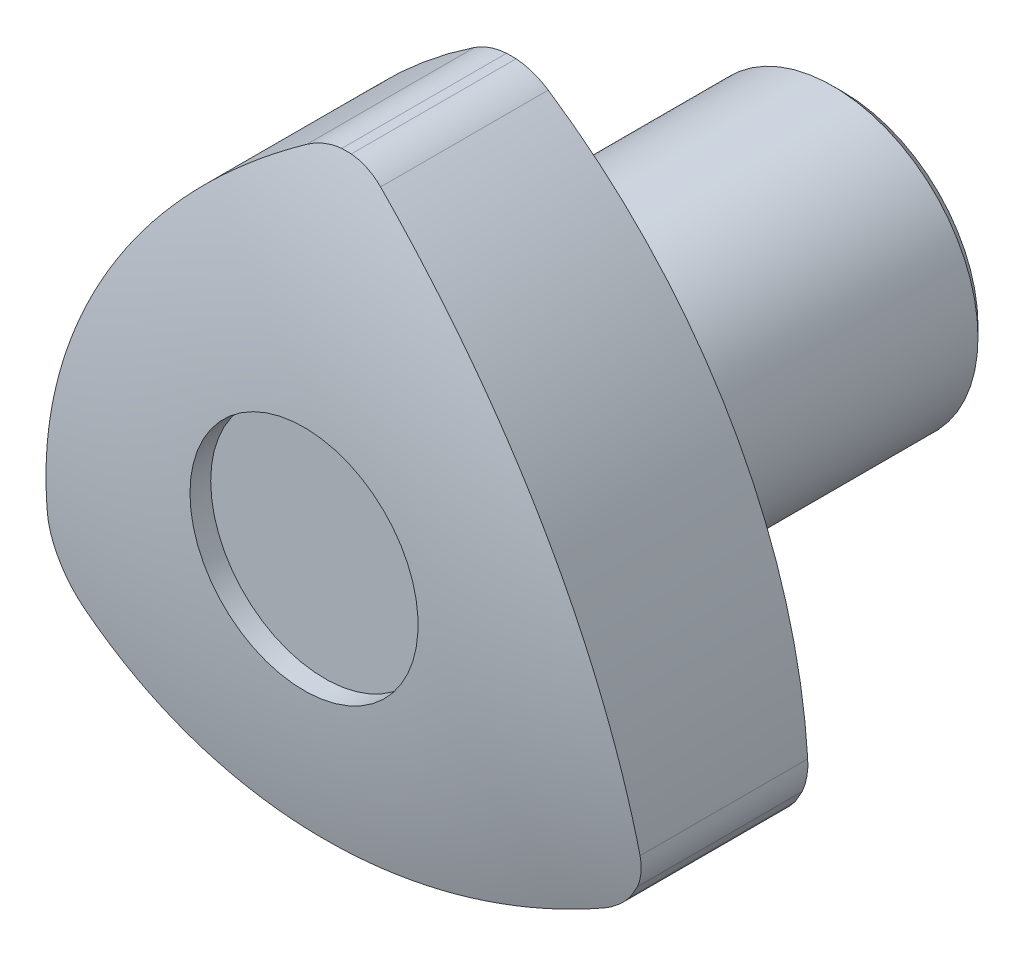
ISO-10303-21;
HEADER;
FILE_DESCRIPTION(('STEP AP214'),'2;1');
FILE_NAME('part.step','',(''),(''),'','','');
FILE_SCHEMA(('AUTOMOTIVE_DESIGN { 1 0 10303 214 1 1 1 1 }'));
ENDSEC;
DATA;
#1=APPLICATION_CONTEXT('core data for automotive mechanical design processes');
#2=APPLICATION_PROTOCOL_DEFINITION('international standard','automotive_design',2000,#1);
#3=PRODUCT_CONTEXT('',#1,'mechanical');
#4=PRODUCT('Part','Part','',(#3));
#5=PRODUCT_RELATED_PRODUCT_CATEGORY('part','',(#4));
#6=PRODUCT_DEFINITION_FORMATION('','',#4);
#7=PRODUCT_DEFINITION_CONTEXT('part definition',#1,'design');
#8=PRODUCT_DEFINITION('design','',#6,#7);
#9=PRODUCT_DEFINITION_SHAPE('','',#8);
#10=(LENGTH_UNIT() NAMED_UNIT(*) SI_UNIT(.MILLI.,.METRE.));
#11=(NAMED_UNIT(*) PLANE_ANGLE_UNIT() SI_UNIT($,.RADIAN.));
#12=(NAMED_UNIT(*) SI_UNIT($,.STERADIAN.) SOLID_ANGLE_UNIT());
#13=UNCERTAINTY_MEASURE_WITH_UNIT(LENGTH_MEASURE(1.E-05),#10,'distance_accuracy_value','');
#14=(GEOMETRIC_REPRESENTATION_CONTEXT(3) GLOBAL_UNCERTAINTY_ASSIGNED_CONTEXT((#13)) GLOBAL_UNIT_ASSIGNED_CONTEXT((#10,
#11,#12)) REPRESENTATION_CONTEXT('',''));
#15=CARTESIAN_POINT('',(0.,0.,0.));
#16=DIRECTION('',(0.,0.,1.));
#17=DIRECTION('',(1.,0.,0.));
#18=AXIS2_PLACEMENT_3D('',#15,#16,#17);
#19=CARTESIAN_POINT('',(16.,0.,16.));
#20=DIRECTION('',(0.,0.,-1.));
#21=DIRECTION('',(1.,0.,0.));
#22=AXIS2_PLACEMENT_3D('',#19,#20,#21);
#23=PLANE('',#22);
#24=CARTESIAN_POINT('',(0.,0.,16.));
#25=DIRECTION('',(0.,0.,1.));
#26=DIRECTION('',(-1.,0.,0.));
#27=AXIS2_PLACEMENT_3D('',#24,#25,#26);
#28=CIRCLE('',#27,7.);
#29=CARTESIAN_POINT('',(-7.,0.,16.));
#30=VERTEX_POINT('',#29);
#31=EDGE_CURVE('E182',#30,#30,#28,.T.);
#32=ORIENTED_EDGE('',*,*,#31,.T.);
#33=EDGE_LOOP('',(#32));
#34=FACE_BOUND('',#33,.T.);
#35=CARTESIAN_POINT('',(-13.8526574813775,-8.00648991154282,16.));
#36=DIRECTION('',(0.,0.,-1.));
#37=DIRECTION('',(1.,0.,0.));
#38=AXIS2_PLACEMENT_3D('',#35,#36,#37);
#39=CIRCLE('',#38,28.2);
#40=CARTESIAN_POINT('',(1.77736900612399,15.4656695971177,16.));
#41=VERTEX_POINT('',#40);
#42=CARTESIAN_POINT('',(14.2898421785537,-6.20656966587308,16.));
#43=VERTEX_POINT('',#42);
#44=EDGE_CURVE('E144',#41,#43,#39,.T.);
#45=ORIENTED_EDGE('',*,*,#44,.T.);
#46=CARTESIAN_POINT('',(11.0963670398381,-6.41081593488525,16.));
#47=DIRECTION('',(0.,0.,-1.));
#48=DIRECTION('',(1.,0.,0.));
#49=AXIS2_PLACEMENT_3D('',#46,#47,#48);
#50=CIRCLE('',#49,3.2);
#51=CARTESIAN_POINT('',(14.0246056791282,-7.70132686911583,16.));
#52=VERTEX_POINT('',#51);
#53=EDGE_CURVE('E132',#43,#52,#50,.T.);
#54=ORIENTED_EDGE('',*,*,#53,.T.);
#55=CARTESIAN_POINT('',(0.,0.,16.));
#56=DIRECTION('',(0.,0.,1.));
#57=DIRECTION('',(-1.,0.,0.));
#58=AXIS2_PLACEMENT_3D('',#55,#56,#57);
#59=CIRCLE('',#58,16.);
#60=CARTESIAN_POINT('',(13.6769958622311,-8.30299850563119,16.));
#61=VERTEX_POINT('',#60);
#62=EDGE_CURVE('E183',#61,#52,#59,.T.);
#63=ORIENTED_EDGE('',*,*,#62,.F.);
#64=CARTESIAN_POINT('',(12.5162221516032,-9.27856966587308,16.));
#65=VERTEX_POINT('',#64);
#66=EDGE_CURVE('E131',#61,#65,#50,.T.);
#67=ORIENTED_EDGE('',*,*,#66,.T.);
#68=CARTESIAN_POINT('',(0.00843924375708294,15.9999977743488,16.));
#69=DIRECTION('',(0.,0.,-1.));
#70=DIRECTION('',(1.,0.,0.));
#71=AXIS2_PLACEMENT_3D('',#68,#69,#70);
#72=CIRCLE('',#71,28.2037338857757);
#73=CARTESIAN_POINT('',(-12.5066346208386,-9.27496080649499,16.));
#74=VERTEX_POINT('',#73);
#75=EDGE_CURVE('E110',#65,#74,#72,.T.);
#76=ORIENTED_EDGE('',*,*,#75,.T.);
#77=CARTESIAN_POINT('',(-11.0926164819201,-6.40432297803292,16.));
#78=DIRECTION('',(0.,0.,-1.));
#79=DIRECTION('',(1.,0.,0.));
#80=AXIS2_PLACEMENT_3D('',#77,#78,#79);
#81=CIRCLE('',#80,3.20000138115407);
#82=CARTESIAN_POINT('',(-13.7231427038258,-8.22650316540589,16.));
#83=VERTEX_POINT('',#82);
#84=EDGE_CURVE('E119',#74,#83,#81,.T.);
#85=ORIENTED_EDGE('',*,*,#84,.T.);
#86=CARTESIAN_POINT('',(-13.9859343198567,-7.77133458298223,16.));
#87=VERTEX_POINT('',#86);
#88=EDGE_CURVE('E180',#87,#83,#59,.T.);
#89=ORIENTED_EDGE('',*,*,#88,.F.);
#90=CARTESIAN_POINT('',(-14.2860931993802,-6.20007975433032,16.));
#91=VERTEX_POINT('',#90);
#92=EDGE_CURVE('E127',#87,#91,#81,.T.);
#93=ORIENTED_EDGE('',*,*,#92,.T.);
#94=CARTESIAN_POINT('',(13.856406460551,-8.,16.));
#95=DIRECTION('',(0.,0.,-1.));
#96=DIRECTION('',(1.,0.,0.));
#97=AXIS2_PLACEMENT_3D('',#94,#95,#96);
#98=CIRCLE('',#97,28.2);
#99=CARTESIAN_POINT('',(-1.77362002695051,15.4721595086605,16.));
#100=VERTEX_POINT('',#99);
#101=EDGE_CURVE('E126',#91,#100,#98,.T.);
#102=ORIENTED_EDGE('',*,*,#101,.T.);
#103=CARTESIAN_POINT('',(-0.00299113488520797,12.8066626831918,16.));
#104=DIRECTION('',(0.,0.,-1.));
#105=DIRECTION('',(1.,0.,0.));
#106=AXIS2_PLACEMENT_3D('',#103,#104,#105);
#107=CIRCLE('',#106,3.2);
#108=CARTESIAN_POINT('',(-0.234427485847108,15.99828252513,16.));
#109=VERTEX_POINT('',#108);
#110=EDGE_CURVE('E141',#100,#109,#107,.T.);
#111=ORIENTED_EDGE('',*,*,#110,.T.);
#112=CARTESIAN_POINT('',(0.226954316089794,15.9983902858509,16.));
#113=VERTEX_POINT('',#112);
#114=EDGE_CURVE('E178',#113,#109,#59,.T.);
#115=ORIENTED_EDGE('',*,*,#114,.F.);
#116=EDGE_CURVE('E140',#113,#41,#107,.T.);
#117=ORIENTED_EDGE('',*,*,#116,.T.);
#118=EDGE_LOOP('',(#45,#54,#63,#67,#76,#85,#89,#93,#102,#111,#115,#117));
#119=FACE_BOUND('',#118,.T.);
#120=ADVANCED_FACE('F14',(#34,#119),#23,.T.);
#121=CARTESIAN_POINT('',(0.,0.,30.097252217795));
#122=DIRECTION('',(0.,0.,1.));
#123=DIRECTION('',(-1.,0.,0.));
#124=AXIS2_PLACEMENT_3D('',#121,#122,#123);
#125=CYLINDRICAL_SURFACE('',#124,16.);
#126=ORIENTED_EDGE('',*,*,#62,.T.);
#127=DIRECTION('',(0.,0.,-1.));
#128=VECTOR('',#127,1.);
#129=CARTESIAN_POINT('',(14.0246056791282,-7.70132686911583,19.973405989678));
#130=LINE('',#129,#128);
#131=CARTESIAN_POINT('',(14.0246056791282,-7.70132686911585,23.9468119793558));
#132=VERTEX_POINT('',#131);
#133=EDGE_CURVE('E165',#52,#132,#130,.F.);
#134=ORIENTED_EDGE('',*,*,#133,.T.);
#135=CARTESIAN_POINT('',(0.,0.,23.9468119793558));
#136=DIRECTION('',(0.,0.,1.));
#137=DIRECTION('',(-1.,0.,0.));
#138=AXIS2_PLACEMENT_3D('',#135,#136,#137);
#139=CIRCLE('',#138,16.);
#140=CARTESIAN_POINT('',(13.6769958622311,-8.30299850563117,23.9468119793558));
#141=VERTEX_POINT('',#140);
#142=EDGE_CURVE('E179',#141,#132,#139,.T.);
#143=ORIENTED_EDGE('',*,*,#142,.F.);
#144=DIRECTION('',(0.,0.,-1.));
#145=VECTOR('',#144,1.);
#146=CARTESIAN_POINT('',(13.6769958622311,-8.30299850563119,19.973405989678));
#147=LINE('',#146,#145);
#148=EDGE_CURVE('E162',#141,#61,#147,.T.);
#149=ORIENTED_EDGE('',*,*,#148,.T.);
#150=EDGE_LOOP('',(#126,#134,#143,#149));
#151=FACE_BOUND('',#150,.T.);
#152=ADVANCED_FACE('F290',(#151),#125,.T.);
#153=ORIENTED_EDGE('',*,*,#114,.T.);
#154=DIRECTION('',(0.,0.,-1.));
#155=VECTOR('',#154,1.);
#156=CARTESIAN_POINT('',(-0.234427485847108,15.99828252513,19.973405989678));
#157=LINE('',#156,#155);
#158=CARTESIAN_POINT('',(-0.234427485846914,15.99828252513,23.9468119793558));
#159=VERTEX_POINT('',#158);
#160=EDGE_CURVE('E159',#109,#159,#157,.F.);
#161=ORIENTED_EDGE('',*,*,#160,.T.);
#162=CARTESIAN_POINT('',(0.226954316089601,15.9983902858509,23.9468119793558));
#163=VERTEX_POINT('',#162);
#164=EDGE_CURVE('E174',#163,#159,#139,.T.);
#165=ORIENTED_EDGE('',*,*,#164,.F.);
#166=DIRECTION('',(0.,0.,-1.));
#167=VECTOR('',#166,1.);
#168=CARTESIAN_POINT('',(0.226954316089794,15.9983902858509,19.973405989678));
#169=LINE('',#168,#167);
#170=EDGE_CURVE('E43',#163,#113,#169,.T.);
#171=ORIENTED_EDGE('',*,*,#170,.T.);
#172=EDGE_LOOP('',(#153,#161,#165,#171));
#173=FACE_BOUND('',#172,.T.);
#174=ADVANCED_FACE('F294',(#173),#125,.T.);
#175=ORIENTED_EDGE('',*,*,#88,.T.);
#176=DIRECTION('',(0.,0.,-1.));
#177=VECTOR('',#176,1.);
#178=CARTESIAN_POINT('',(-13.7231427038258,-8.2265031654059,19.9734059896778));
#179=LINE('',#178,#177);
#180=CARTESIAN_POINT('',(-13.7231427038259,-8.22650316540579,23.9468119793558));
#181=VERTEX_POINT('',#180);
#182=EDGE_CURVE('E122',#83,#181,#179,.F.);
#183=ORIENTED_EDGE('',*,*,#182,.T.);
#184=CARTESIAN_POINT('',(-13.9859343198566,-7.77133458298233,23.9468119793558));
#185=VERTEX_POINT('',#184);
#186=EDGE_CURVE('E175',#185,#181,#139,.T.);
#187=ORIENTED_EDGE('',*,*,#186,.F.);
#188=DIRECTION('',(0.,0.,-1.));
#189=VECTOR('',#188,1.);
#190=CARTESIAN_POINT('',(-13.9859343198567,-7.77133458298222,19.9734059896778));
#191=LINE('',#190,#189);
#192=EDGE_CURVE('E154',#185,#87,#191,.T.);
#193=ORIENTED_EDGE('',*,*,#192,.T.);
#194=EDGE_LOOP('',(#175,#183,#187,#193));
#195=FACE_BOUND('',#194,.T.);
#196=ADVANCED_FACE('F306',(#195),#125,.T.);
#197=CARTESIAN_POINT('',(0.,0.,-15.9102368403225));
#198=DIRECTION('',(0.,0.,1.));
#199=DIRECTION('',(-1.,0.,0.));
#200=AXIS2_PLACEMENT_3D('',#197,#198,#199);
#201=DEGENERATE_TOROIDAL_SURFACE('',#200,2.75554231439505,42.,.T.);
#202=CARTESIAN_POINT('',(0.,0.,26.));
#203=DIRECTION('',(0.,0.,1.));
#204=DIRECTION('',(-1.,0.,0.));
#205=AXIS2_PLACEMENT_3D('',#202,#203,#204);
#206=CIRCLE('',#205,5.5);
#207=CARTESIAN_POINT('',(-5.5,0.,26.));
#208=VERTEX_POINT('',#207);
#209=EDGE_CURVE('E171',#208,#208,#206,.T.);
#210=ORIENTED_EDGE('',*,*,#209,.F.);
#211=EDGE_LOOP('',(#210));
#212=FACE_BOUND('',#211,.T.);
#213=CARTESIAN_POINT('',(14.2898293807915,-6.20636966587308,24.0841155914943));
#214=CARTESIAN_POINT('',(14.29547081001,-6.29432646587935,24.0712218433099));
#215=CARTESIAN_POINT('',(14.2974654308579,-6.38263446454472,24.0590980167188));
#216=CARTESIAN_POINT('',(14.2941366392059,-6.55936528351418,24.0364847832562));
#217=CARTESIAN_POINT('',(14.2888096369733,-6.6477881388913,24.0259961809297));
#218=CARTESIAN_POINT('',(14.2709914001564,-6.82227371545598,24.0069572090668));
#219=CARTESIAN_POINT('',(14.2586486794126,-6.90834776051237,23.9983716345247));
#220=CARTESIAN_POINT('',(14.226968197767,-7.07931416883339,23.9829532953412));
#221=CARTESIAN_POINT('',(14.2076340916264,-7.16420712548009,23.9761196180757));
#222=CARTESIAN_POINT('',(14.1636909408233,-7.32627240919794,23.9646858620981));
#223=CARTESIAN_POINT('',(14.1395546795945,-7.4035645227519,23.959961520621));
#224=CARTESIAN_POINT('',(14.0852074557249,-7.55690777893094,23.9520739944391));
#225=CARTESIAN_POINT('',(14.0549400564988,-7.6329397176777,23.9489263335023));
#226=CARTESIAN_POINT('',(14.0217793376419,-7.7077210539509,23.9466119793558));
#227=B_SPLINE_CURVE_WITH_KNOTS('',3,(#213,#214,#215,#216,#217,#218,#219,#220,#221,#222,#223,
#224,#225,#226),.UNSPECIFIED.,.F.,.F.,(4,2,2,2,2,2,4),(0.,0.267156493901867,0.534444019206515,
0.796273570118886,1.05796644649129,1.30105304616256,1.54648817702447),.UNSPECIFIED.);
#228=CARTESIAN_POINT('',(14.2898421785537,-6.20656966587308,24.0840862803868));
#229=VERTEX_POINT('',#228);
#230=EDGE_CURVE('E9',#229,#132,#227,.T.);
#231=ORIENTED_EDGE('',*,*,#230,.F.);
#232=CARTESIAN_POINT('',(1.777169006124,15.4658027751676,24.0879109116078));
#233=CARTESIAN_POINT('',(2.05499469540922,15.2808036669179,24.1366228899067));
#234=CARTESIAN_POINT('',(2.32974647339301,15.0907294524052,24.1833798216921));
#235=CARTESIAN_POINT('',(2.87273940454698,14.7006206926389,24.2729933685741));
#236=CARTESIAN_POINT('',(3.14098052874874,14.5005861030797,24.3158499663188));
#237=CARTESIAN_POINT('',(3.93525488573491,13.8859337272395,24.4385624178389));
#238=CARTESIAN_POINT('',(4.45098127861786,13.4566727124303,24.5125857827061));
#239=CARTESIAN_POINT('',(5.45131969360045,12.5616123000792,24.6451274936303));
#240=CARTESIAN_POINT('',(5.93594514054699,12.0958288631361,24.7036525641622));
#241=CARTESIAN_POINT('',(6.87147447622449,11.1299264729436,24.8054651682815));
#242=CARTESIAN_POINT('',(7.32237596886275,10.6298050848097,24.8487516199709));
#243=CARTESIAN_POINT('',(8.24423977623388,9.53051624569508,24.9250068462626));
#244=CARTESIAN_POINT('',(8.7101348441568,8.92694248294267,24.9558906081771));
#245=CARTESIAN_POINT('',(9.59182464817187,7.68354619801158,24.9988120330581));
#246=CARTESIAN_POINT('',(10.0076140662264,7.0437198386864,25.010847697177));
#247=CARTESIAN_POINT('',(10.786071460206,5.7323078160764,25.0162185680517));
#248=CARTESIAN_POINT('',(11.1487307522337,5.06071698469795,25.0095507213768));
#249=CARTESIAN_POINT('',(11.818251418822,3.69075964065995,24.9774235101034));
#250=CARTESIAN_POINT('',(12.1251166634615,2.99239498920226,24.9519654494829));
#251=CARTESIAN_POINT('',(12.669489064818,1.60334473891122,24.8834281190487));
#252=CARTESIAN_POINT('',(12.9093427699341,0.913539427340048,24.84112248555));
#253=CARTESIAN_POINT('',(13.3345456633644,-0.481354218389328,24.7386697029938));
#254=CARTESIAN_POINT('',(13.5198950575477,-1.1864424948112,24.6785226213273));
#255=CARTESIAN_POINT('',(13.835337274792,-2.6078577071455,24.5400257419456));
#256=CARTESIAN_POINT('',(13.9653809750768,-3.32419405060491,24.4616598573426));
#257=CARTESIAN_POINT('',(14.1184987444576,-4.40281623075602,24.3303832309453));
#258=CARTESIAN_POINT('',(14.1625494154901,-4.76308582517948,24.2843301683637));
#259=CARTESIAN_POINT('',(14.2366771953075,-5.4844439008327,24.1876370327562));
#260=CARTESIAN_POINT('',(14.2667543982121,-5.84553237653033,24.136996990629));
#261=CARTESIAN_POINT('',(14.289854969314,-6.20676966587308,24.0840569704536));
#262=B_SPLINE_CURVE_WITH_KNOTS('',3,(#232,#233,#234,#235,#236,#237,#238,#239,#240,#241,#242,
#243,#244,#245,#246,#247,#248,#249,#250,#251,#252,#253,#254,#255,#256,#257,#258,#259,#260,#261),
.UNSPECIFIED.,.F.,.F.,(4,2,2,2,2,2,2,2,2,2,2,2,2,2,4),(0.,1.01183950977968,2.0236835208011,
4.04685508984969,6.06914739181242,8.09158324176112,10.3780757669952,12.6648107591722,
14.9519190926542,17.2388687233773,19.4310825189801,21.6232880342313,23.8174366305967,
24.914768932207,26.0120938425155),.UNSPECIFIED.);
#263=CARTESIAN_POINT('',(1.77736900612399,15.4656695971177,24.0879459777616));
#264=VERTEX_POINT('',#263);
#265=EDGE_CURVE('E28',#264,#229,#262,.T.);
#266=ORIENTED_EDGE('',*,*,#265,.F.);
#267=CARTESIAN_POINT('',(0.216303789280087,15.9991397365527,23.9466119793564));
#268=CARTESIAN_POINT('',(0.305160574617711,15.9930476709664,23.9482374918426));
#269=CARTESIAN_POINT('',(0.39373977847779,15.9832247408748,23.950855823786));
#270=CARTESIAN_POINT('',(0.569710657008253,15.9562527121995,23.9580373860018));
#271=CARTESIAN_POINT('',(0.657102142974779,15.9391024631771,23.962600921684));
#272=CARTESIAN_POINT('',(0.828141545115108,15.898068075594,23.973510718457));
#273=CARTESIAN_POINT('',(0.91182952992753,15.8743397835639,23.9798157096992));
#274=CARTESIAN_POINT('',(1.07683039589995,15.8202192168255,23.9941833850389));
#275=CARTESIAN_POINT('',(1.15814409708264,15.7898292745,24.0022454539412));
#276=CARTESIAN_POINT('',(1.33193139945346,15.7167061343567,24.0216241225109));
#277=CARTESIAN_POINT('',(1.42385344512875,15.6727421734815,24.0332637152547));
#278=CARTESIAN_POINT('',(1.60405317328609,15.5757869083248,24.0588954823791));
#279=CARTESIAN_POINT('',(1.69226685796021,15.5226842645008,24.0729166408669));
#280=CARTESIAN_POINT('',(1.777569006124,15.4655356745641,24.0879812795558));
#281=B_SPLINE_CURVE_WITH_KNOTS('',3,(#267,#268,#269,#270,#271,#272,#273,#274,#275,#276,#277,
#278,#279,#280),.UNSPECIFIED.,.F.,.F.,(4,2,2,2,2,2,4),(0.,0.26715276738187,0.5343474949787,
0.795685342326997,1.05693183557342,1.36411166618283,1.67533998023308),.UNSPECIFIED.);
#282=EDGE_CURVE('E253',#163,#264,#281,.T.);
#283=ORIENTED_EDGE('',*,*,#282,.F.);
#284=ORIENTED_EDGE('',*,*,#164,.T.);
#285=CARTESIAN_POINT('',(-1.77382002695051,15.4720266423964,24.086052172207));
#286=CARTESIAN_POINT('',(-1.70042106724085,15.5208040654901,24.0732016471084));
#287=CARTESIAN_POINT('',(-1.62489916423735,15.5665969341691,24.0611213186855));
#288=CARTESIAN_POINT('',(-1.47011280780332,15.6518952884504,24.0385963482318));
#289=CARTESIAN_POINT('',(-1.39084689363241,15.6913982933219,24.0281523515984));
#290=CARTESIAN_POINT('',(-1.23090716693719,15.7629664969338,24.0092154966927));
#291=CARTESIAN_POINT('',(-1.15030232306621,15.7951757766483,24.0006848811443));
#292=CARTESIAN_POINT('',(-0.986631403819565,15.8529690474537,23.9853692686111));
#293=CARTESIAN_POINT('',(-0.903566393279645,15.8785558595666,23.978583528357));
#294=CARTESIAN_POINT('',(-0.722832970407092,15.9262488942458,23.9659307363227));
#295=CARTESIAN_POINT('',(-0.624850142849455,15.9472496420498,23.9603562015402));
#296=CARTESIAN_POINT('',(-0.42597136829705,15.9802117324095,23.9516062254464));
#297=CARTESIAN_POINT('',(-0.325054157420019,15.9920532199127,23.9484625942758));
#298=CARTESIAN_POINT('',(-0.223777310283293,15.9990369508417,23.9466119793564));
#299=B_SPLINE_CURVE_WITH_KNOTS('',3,(#285,#286,#287,#288,#289,#290,#291,#292,#293,#294,#295,
#296,#297,#298),.UNSPECIFIED.,.F.,.F.,(4,2,2,2,2,2,4),(0.,0.267110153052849,0.534325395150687,
0.795682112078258,1.05692731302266,1.35753891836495,1.66202063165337),.UNSPECIFIED.);
#300=CARTESIAN_POINT('',(-1.77362002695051,15.4721595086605,24.086017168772));
#301=VERTEX_POINT('',#300);
#302=EDGE_CURVE('E247',#301,#159,#299,.T.);
#303=ORIENTED_EDGE('',*,*,#302,.F.);
#304=CARTESIAN_POINT('',(-14.2861059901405,-6.20027975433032,24.085987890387));
#305=CARTESIAN_POINT('',(-14.2647959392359,-5.86704324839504,24.1347717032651));
#306=CARTESIAN_POINT('',(-14.2375490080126,-5.53393107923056,24.1815988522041));
#307=CARTESIAN_POINT('',(-14.1711643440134,-4.86836503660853,24.2713495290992));
#308=CARTESIAN_POINT('',(-14.1320265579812,-4.53591116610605,24.3142730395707));
#309=CARTESIAN_POINT('',(-13.9967747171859,-3.5403251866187,24.4371811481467));
#310=CARTESIAN_POINT('',(-13.8828113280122,-2.87879835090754,24.5113281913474));
#311=CARTESIAN_POINT('',(-13.6076458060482,-1.56442981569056,24.6441030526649));
#312=CARTESIAN_POINT('',(-13.4464642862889,-0.911584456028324,24.702737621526));
#313=CARTESIAN_POINT('',(-13.0774672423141,0.382057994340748,24.8047551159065));
#314=CARTESIAN_POINT('',(-12.869648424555,1.02285423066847,24.8481369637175));
#315=CARTESIAN_POINT('',(-12.3783102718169,2.37107075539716,24.9245645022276));
#316=CARTESIAN_POINT('',(-12.0884595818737,3.07631150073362,24.9555309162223));
#317=CARTESIAN_POINT('',(-11.452315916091,4.46152345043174,24.9986157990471));
#318=CARTESIAN_POINT('',(-11.1060169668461,5.14149197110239,25.0107322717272));
#319=CARTESIAN_POINT('',(-10.3593553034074,6.47129675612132,25.0162638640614));
#320=CARTESIAN_POINT('',(-9.95898388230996,7.12112814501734,25.009675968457));
#321=CARTESIAN_POINT('',(-9.10715475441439,8.38585030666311,24.9777088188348));
#322=CARTESIAN_POINT('',(-8.65570060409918,9.00074350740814,24.9523308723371));
#323=CARTESIAN_POINT('',(-7.72496201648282,10.1663779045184,24.8839654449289));
#324=CARTESIAN_POINT('',(-7.24763174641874,10.7187266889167,24.841759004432));
#325=CARTESIAN_POINT('',(-6.25251804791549,11.7838927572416,24.7395206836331));
#326=CARTESIAN_POINT('',(-5.73473479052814,12.2967102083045,24.679488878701));
#327=CARTESIAN_POINT('',(-4.66183819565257,13.2801427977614,24.5412388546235));
#328=CARTESIAN_POINT('',(-4.10669225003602,13.7507202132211,24.4630045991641));
#329=CARTESIAN_POINT('',(-3.24945191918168,14.4223448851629,24.3319370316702));
#330=CARTESIAN_POINT('',(-2.95958268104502,14.6405365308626,24.2859555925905));
#331=CARTESIAN_POINT('',(-2.37215383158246,15.0652372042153,24.1894094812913));
#332=CARTESIAN_POINT('',(-2.0745942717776,15.2717463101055,24.1388448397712));
#333=CARTESIAN_POINT('',(-1.77342002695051,15.4722926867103,24.0859820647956));
#334=B_SPLINE_CURVE_WITH_KNOTS('',3,(#304,#305,#306,#307,#308,#309,#310,#311,#312,#313,#314,
#315,#316,#317,#318,#319,#320,#321,#322,#323,#324,#325,#326,#327,#328,#329,#330,#331,#332,#333),
.UNSPECIFIED.,.F.,.F.,(4,2,2,2,2,2,2,2,2,2,2,2,2,2,4),(0.,1.01226575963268,2.02453605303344,
4.04856041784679,6.07170251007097,8.0949875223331,10.3815263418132,12.6683072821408,
14.9554568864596,17.2424473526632,19.4337696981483,21.6250827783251,23.8183337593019,
24.9152174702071,26.0120938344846),.UNSPECIFIED.);
#335=CARTESIAN_POINT('',(-14.2860931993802,-6.20007975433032,24.086017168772));
#336=VERTEX_POINT('',#335);
#337=EDGE_CURVE('E236',#336,#301,#334,.T.);
#338=ORIENTED_EDGE('',*,*,#337,.F.);
#339=CARTESIAN_POINT('',(-13.9819408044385,-7.77975520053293,23.9466119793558));
#340=CARTESIAN_POINT('',(-14.0202264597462,-7.69935683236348,23.9484851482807));
#341=CARTESIAN_POINT('',(-14.0551251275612,-7.6173726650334,23.9513499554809));
#342=CARTESIAN_POINT('',(-14.1179588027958,-7.45084762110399,23.9590198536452));
#343=CARTESIAN_POINT('',(-14.1458925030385,-7.36630626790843,23.9638253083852));
#344=CARTESIAN_POINT('',(-14.1940719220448,-7.19713864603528,23.9752098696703));
#345=CARTESIAN_POINT('',(-14.2144691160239,-7.11255276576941,23.9817488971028));
#346=CARTESIAN_POINT('',(-14.2482865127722,-6.94218490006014,23.996577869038));
#347=CARTESIAN_POINT('',(-14.2617093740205,-6.85640338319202,24.0048671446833));
#348=CARTESIAN_POINT('',(-14.2824719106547,-6.67603675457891,24.0239905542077));
#349=CARTESIAN_POINT('',(-14.2891136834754,-6.5813884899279,24.0349915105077));
#350=CARTESIAN_POINT('',(-14.2940276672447,-6.39098131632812,24.0590269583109));
#351=CARTESIAN_POINT('',(-14.292198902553,-6.29522265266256,24.0720841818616));
#352=CARTESIAN_POINT('',(-14.2860804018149,-6.19987975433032,24.086046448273));
#353=B_SPLINE_CURVE_WITH_KNOTS('',3,(#339,#340,#341,#342,#343,#344,#345,#346,#347,#348,#349,
#350,#351,#352),.UNSPECIFIED.,.F.,.F.,(4,2,2,2,2,2,4),(0.,0.267117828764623,0.534285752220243,
0.795746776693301,1.05710806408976,1.34326411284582,1.63284009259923),.UNSPECIFIED.);
#354=EDGE_CURVE('E230',#185,#336,#353,.T.);
#355=ORIENTED_EDGE('',*,*,#354,.F.);
#356=ORIENTED_EDGE('',*,*,#186,.T.);
#357=CARTESIAN_POINT('',(-12.5064346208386,-9.27505931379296,24.0870030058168));
#358=CARTESIAN_POINT('',(-12.5855084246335,-9.23612739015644,24.0740844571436));
#359=CARTESIAN_POINT('',(-12.6630695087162,-9.19385893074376,24.0619342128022));
#360=CARTESIAN_POINT('',(-12.814639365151,-9.10292311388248,24.0392659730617));
#361=CARTESIAN_POINT('',(-12.8886466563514,-9.05425311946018,24.0287486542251));
#362=CARTESIAN_POINT('',(-13.0309600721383,-8.95193951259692,24.0096614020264));
#363=CARTESIAN_POINT('',(-13.0993548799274,-8.89842622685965,24.0010542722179));
#364=CARTESIAN_POINT('',(-13.2316503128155,-8.78593588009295,23.9855851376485));
#365=CARTESIAN_POINT('',(-13.295552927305,-8.72696126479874,23.9787223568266));
#366=CARTESIAN_POINT('',(-13.4249897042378,-8.5973337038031,23.9661656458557));
#367=CARTESIAN_POINT('',(-13.4899696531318,-8.52610615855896,23.9606747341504));
#368=CARTESIAN_POINT('',(-13.6140641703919,-8.377101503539,23.9519100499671));
#369=CARTESIAN_POINT('',(-13.6730974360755,-8.29925504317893,23.9486641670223));
#370=CARTESIAN_POINT('',(-13.7284384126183,-8.21883436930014,23.9466119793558));
#371=B_SPLINE_CURVE_WITH_KNOTS('',3,(#357,#358,#359,#360,#361,#362,#363,#364,#365,#366,#367,
#368,#369,#370),.UNSPECIFIED.,.F.,.F.,(4,2,2,2,2,2,4),(0.,0.267168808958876,0.534448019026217,
0.795946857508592,1.05732915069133,1.3466178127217,1.63943864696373),.UNSPECIFIED.);
#372=CARTESIAN_POINT('',(-12.5066346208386,-9.27496080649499,24.0869703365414));
#373=VERTEX_POINT('',#372);
#374=EDGE_CURVE('E204',#373,#181,#371,.T.);
#375=ORIENTED_EDGE('',*,*,#374,.F.);
#376=CARTESIAN_POINT('',(12.5164221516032,-9.27847070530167,24.083780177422));
#377=CARTESIAN_POINT('',(12.216999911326,-9.42662771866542,24.1326212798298));
#378=CARTESIAN_POINT('',(11.9147157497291,-9.56957630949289,24.1795040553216));
#379=CARTESIAN_POINT('',(11.3047702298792,-9.84483688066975,24.269362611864));
#380=CARTESIAN_POINT('',(10.9971088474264,-9.97714881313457,24.3123383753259));
#381=CARTESIAN_POINT('',(10.0667409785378,-10.3577333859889,24.4353980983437));
#382=CARTESIAN_POINT('',(9.4364978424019,-10.5897305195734,24.5096393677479));
#383=CARTESIAN_POINT('',(8.15991250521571,-11.0084313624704,24.6425885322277));
#384=CARTESIAN_POINT('',(7.51357743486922,-11.1951547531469,24.7013031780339));
#385=CARTESIAN_POINT('',(6.2080278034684,-11.5221493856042,24.8034665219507));
#386=CARTESIAN_POINT('',(5.54881233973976,-11.6624173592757,24.8469141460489));
#387=CARTESIAN_POINT('',(4.13504771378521,-11.9105976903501,24.9234528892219));
#388=CARTESIAN_POINT('',(3.37922550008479,-12.0119517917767,24.9544692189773));
#389=CARTESIAN_POINT('',(1.86126322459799,-12.1531335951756,24.9976486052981));
#390=CARTESIAN_POINT('',(1.09912250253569,-12.1929547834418,25.0098096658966));
#391=CARTESIAN_POINT('',(-0.426072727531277,-12.2107007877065,25.0154254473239));
#392=CARTESIAN_POINT('',(-1.18912736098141,-12.1886158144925,25.0088772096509));
#393=CARTESIAN_POINT('',(-2.71049881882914,-12.0827260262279,24.9769850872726));
#394=CARTESIAN_POINT('',(-3.46881597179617,-11.998925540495,24.9516425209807));
#395=CARTESIAN_POINT('',(-4.94304594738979,-11.7752648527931,24.8833769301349));
#396=CARTESIAN_POINT('',(-5.65938434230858,-11.6379581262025,24.8412529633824));
#397=CARTESIAN_POINT('',(-7.07806490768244,-11.3086526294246,24.7392132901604));
#398=CARTESIAN_POINT('',(-7.78040715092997,-11.1166541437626,24.6792976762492));
#399=CARTESIAN_POINT('',(-9.16722885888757,-10.6793322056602,24.5413152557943));
#400=CARTESIAN_POINT('',(-9.85169212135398,-10.4339621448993,24.4632325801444));
#401=CARTESIAN_POINT('',(-10.861024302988,-10.0276236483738,24.3324184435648));
#402=CARTESIAN_POINT('',(-11.1946128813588,-9.88577793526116,24.2865258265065));
#403=CARTESIAN_POINT('',(-11.8555292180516,-9.58960880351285,24.1901659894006));
#404=CARTESIAN_POINT('',(-12.1828570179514,-9.43528546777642,24.1396987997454));
#405=CARTESIAN_POINT('',(-12.5068346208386,-9.27486177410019,24.0869377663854));
#406=B_SPLINE_CURVE_WITH_KNOTS('',3,(#376,#377,#378,#379,#380,#381,#382,#383,#384,#385,#386,
#387,#388,#389,#390,#391,#392,#393,#394,#395,#396,#397,#398,#399,#400,#401,#402,#403,#404,#405),
.UNSPECIFIED.,.F.,.F.,(4,2,2,2,2,2,2,2,2,2,2,2,2,2,4),(0.,1.0127503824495,2.02550532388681,
4.05049915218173,6.07461109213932,8.09886539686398,10.3857282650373,12.6728331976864,
14.9602998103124,17.2476059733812,19.4369933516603,21.6263693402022,23.8176649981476,
24.9135712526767,26.0094702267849),.UNSPECIFIED.);
#407=CARTESIAN_POINT('',(12.5162221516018,-9.27856966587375,24.0838128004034));
#408=VERTEX_POINT('',#407);
#409=EDGE_CURVE('E113',#408,#373,#406,.T.);
#410=ORIENTED_EDGE('',*,*,#409,.F.);
#411=CARTESIAN_POINT('',(13.6811235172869,-8.29735614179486,23.9466119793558));
#412=CARTESIAN_POINT('',(13.6286394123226,-8.36928461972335,23.9491301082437));
#413=CARTESIAN_POINT('',(13.5731533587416,-8.4389836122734,23.9526370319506));
#414=CARTESIAN_POINT('',(13.4566261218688,-8.5734705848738,23.9615796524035));
#415=CARTESIAN_POINT('',(13.3955835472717,-8.63825732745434,23.9670158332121));
#416=CARTESIAN_POINT('',(13.2697026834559,-8.76117753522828,23.9796381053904));
#417=CARTESIAN_POINT('',(13.2049659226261,-8.81941892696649,23.986786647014));
#418=CARTESIAN_POINT('',(13.0711227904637,-8.93031754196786,24.002816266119));
#419=CARTESIAN_POINT('',(13.0020183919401,-8.98297725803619,24.0116965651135));
#420=CARTESIAN_POINT('',(12.8652093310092,-9.07870598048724,24.0303883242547));
#421=CARTESIAN_POINT('',(12.7977831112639,-9.12219705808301,24.0400813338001));
#422=CARTESIAN_POINT('',(12.6593556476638,-9.20431109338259,24.0609077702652));
#423=CARTESIAN_POINT('',(12.5883264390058,-9.24288366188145,24.0720540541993));
#424=CARTESIAN_POINT('',(12.5160221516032,-9.27866867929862,24.0838454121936));
#425=B_SPLINE_CURVE_WITH_KNOTS('',3,(#411,#412,#413,#414,#415,#416,#417,#418,#419,#420,#421,
#422,#423,#424),.UNSPECIFIED.,.F.,.F.,(4,2,2,2,2,2,4),(0.,0.267142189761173,0.534351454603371,
0.796165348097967,1.05786181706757,1.30008614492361,1.54462083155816),.UNSPECIFIED.);
#426=EDGE_CURVE('E237',#141,#408,#425,.T.);
#427=ORIENTED_EDGE('',*,*,#426,.F.);
#428=ORIENTED_EDGE('',*,*,#142,.T.);
#429=EDGE_LOOP('',(#231,#266,#283,#284,#303,#338,#355,#356,#375,#410,#427,#428));
#430=FACE_BOUND('',#429,.T.);
#431=ADVANCED_FACE('F211',(#212,#430),#201,.T.);
#432=CARTESIAN_POINT('',(3.,0.,12.));
#433=DIRECTION('',(0.,0.,-1.));
#434=DIRECTION('',(1.,0.,0.));
#435=AXIS2_PLACEMENT_3D('',#432,#433,#434);
#436=PLANE('',#435);
#437=CARTESIAN_POINT('',(0.,0.,12.));
#438=DIRECTION('',(0.,0.,1.));
#439=DIRECTION('',(-1.,0.,0.));
#440=AXIS2_PLACEMENT_3D('',#437,#438,#439);
#441=CIRCLE('',#440,3.);
#442=CARTESIAN_POINT('',(-3.,0.,12.));
#443=VERTEX_POINT('',#442);
#444=EDGE_CURVE('E195',#443,#443,#441,.T.);
#445=ORIENTED_EDGE('',*,*,#444,.F.);
#446=EDGE_LOOP('',(#445));
#447=FACE_BOUND('',#446,.T.);
#448=ADVANCED_FACE('F16',(#447),#436,.T.);
#449=CARTESIAN_POINT('',(0.,0.,30.097252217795));
#450=DIRECTION('',(0.,0.,1.));
#451=DIRECTION('',(-1.,0.,0.));
#452=AXIS2_PLACEMENT_3D('',#449,#450,#451);
#453=CYLINDRICAL_SURFACE('',#452,3.);
#454=ORIENTED_EDGE('',*,*,#444,.T.);
#455=EDGE_LOOP('',(#454));
#456=FACE_BOUND('',#455,.T.);
#457=CARTESIAN_POINT('',(0.,0.,0.));
#458=DIRECTION('',(0.,0.,1.));
#459=DIRECTION('',(-1.,0.,0.));
#460=AXIS2_PLACEMENT_3D('',#457,#458,#459);
#461=CIRCLE('',#460,3.);
#462=CARTESIAN_POINT('',(-3.,0.,0.));
#463=VERTEX_POINT('',#462);
#464=EDGE_CURVE('E192',#463,#463,#461,.T.);
#465=ORIENTED_EDGE('',*,*,#464,.F.);
#466=EDGE_LOOP('',(#465));
#467=FACE_BOUND('',#466,.T.);
#468=ADVANCED_FACE('F334',(#456,#467),#453,.F.);
#469=CARTESIAN_POINT('',(6.5,0.,0.));
#470=DIRECTION('',(0.,0.,-1.));
#471=DIRECTION('',(1.,0.,0.));
#472=AXIS2_PLACEMENT_3D('',#469,#470,#471);
#473=PLANE('',#472);
#474=ORIENTED_EDGE('',*,*,#464,.T.);
#475=EDGE_LOOP('',(#474));
#476=FACE_BOUND('',#475,.T.);
#477=CARTESIAN_POINT('',(0.,0.,0.));
#478=DIRECTION('',(0.,0.,1.));
#479=DIRECTION('',(-1.,0.,0.));
#480=AXIS2_PLACEMENT_3D('',#477,#478,#479);
#481=CIRCLE('',#480,6.5);
#482=CARTESIAN_POINT('',(-6.5,0.,0.));
#483=VERTEX_POINT('',#482);
#484=EDGE_CURVE('E189',#483,#483,#481,.T.);
#485=ORIENTED_EDGE('',*,*,#484,.F.);
#486=EDGE_LOOP('',(#485));
#487=FACE_BOUND('',#486,.T.);
#488=ADVANCED_FACE('F331',(#476,#487),#473,.T.);
#489=CARTESIAN_POINT('',(0.,0.,0.));
#490=DIRECTION('',(0.,0.,1.));
#491=DIRECTION('',(-1.,0.,0.));
#492=AXIS2_PLACEMENT_3D('',#489,#490,#491);
#493=CONICAL_SURFACE('',#492,6.5,0.785398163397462);
#494=CARTESIAN_POINT('',(0.,0.,0.5));
#495=DIRECTION('',(0.,0.,1.));
#496=DIRECTION('',(-1.,0.,0.));
#497=AXIS2_PLACEMENT_3D('',#494,#495,#496);
#498=CIRCLE('',#497,7.);
#499=CARTESIAN_POINT('',(-7.,0.,0.500000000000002));
#500=VERTEX_POINT('',#499);
#501=EDGE_CURVE('E186',#500,#500,#498,.T.);
#502=ORIENTED_EDGE('',*,*,#501,.F.);
#503=EDGE_LOOP('',(#502));
#504=FACE_BOUND('',#503,.T.);
#505=ORIENTED_EDGE('',*,*,#484,.T.);
#506=EDGE_LOOP('',(#505));
#507=FACE_BOUND('',#506,.T.);
#508=ADVANCED_FACE('F327',(#504,#507),#493,.T.);
#509=CARTESIAN_POINT('',(0.,0.,30.097252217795));
#510=DIRECTION('',(0.,0.,1.));
#511=DIRECTION('',(-1.,0.,0.));
#512=AXIS2_PLACEMENT_3D('',#509,#510,#511);
#513=CYLINDRICAL_SURFACE('',#512,7.);
#514=ORIENTED_EDGE('',*,*,#501,.T.);
#515=EDGE_LOOP('',(#514));
#516=FACE_BOUND('',#515,.T.);
#517=ORIENTED_EDGE('',*,*,#31,.F.);
#518=EDGE_LOOP('',(#517));
#519=FACE_BOUND('',#518,.T.);
#520=ADVANCED_FACE('F323',(#516,#519),#513,.T.);
#521=CARTESIAN_POINT('',(0.,0.,30.097252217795));
#522=DIRECTION('',(0.,0.,1.));
#523=DIRECTION('',(-1.,0.,0.));
#524=AXIS2_PLACEMENT_3D('',#521,#522,#523);
#525=CYLINDRICAL_SURFACE('',#524,5.5);
#526=CARTESIAN_POINT('',(0.,0.,25.));
#527=DIRECTION('',(0.,0.,1.));
#528=DIRECTION('',(-1.,0.,0.));
#529=AXIS2_PLACEMENT_3D('',#526,#527,#528);
#530=CIRCLE('',#529,5.5);
#531=CARTESIAN_POINT('',(-5.5,0.,25.));
#532=VERTEX_POINT('',#531);
#533=EDGE_CURVE('E168',#532,#532,#530,.T.);
#534=ORIENTED_EDGE('',*,*,#533,.F.);
#535=EDGE_LOOP('',(#534));
#536=FACE_BOUND('',#535,.T.);
#537=ORIENTED_EDGE('',*,*,#209,.T.);
#538=EDGE_LOOP('',(#537));
#539=FACE_BOUND('',#538,.T.);
#540=ADVANCED_FACE('F326',(#536,#539),#525,.F.);
#541=CARTESIAN_POINT('',(5.5,0.,25.));
#542=DIRECTION('',(0.,0.,-1.));
#543=DIRECTION('',(1.,0.,0.));
#544=AXIS2_PLACEMENT_3D('',#541,#542,#543);
#545=PLANE('',#544);
#546=ORIENTED_EDGE('',*,*,#533,.T.);
#547=EDGE_LOOP('',(#546));
#548=FACE_BOUND('',#547,.T.);
#549=ADVANCED_FACE('F217',(#548),#545,.F.);
#550=CARTESIAN_POINT('',(0.00843924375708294,15.9999977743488,26.));
#551=DIRECTION('',(0.,0.,-1.));
#552=DIRECTION('',(1.,0.,0.));
#553=AXIS2_PLACEMENT_3D('',#550,#551,#552);
#554=CYLINDRICAL_SURFACE('',#553,28.2037338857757);
#555=ORIENTED_EDGE('',*,*,#409,.T.);
#556=DIRECTION('',(0.,0.,-1.));
#557=VECTOR('',#556,1.);
#558=CARTESIAN_POINT('',(-12.5066346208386,-9.27496080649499,26.));
#559=LINE('',#558,#557);
#560=EDGE_CURVE('E106',#373,#74,#559,.T.);
#561=ORIENTED_EDGE('',*,*,#560,.T.);
#562=ORIENTED_EDGE('',*,*,#75,.F.);
#563=DIRECTION('',(0.,0.,-1.));
#564=VECTOR('',#563,1.);
#565=CARTESIAN_POINT('',(12.5162221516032,-9.27856966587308,26.));
#566=LINE('',#565,#564);
#567=EDGE_CURVE('E35',#408,#65,#566,.T.);
#568=ORIENTED_EDGE('',*,*,#567,.F.);
#569=EDGE_LOOP('',(#555,#561,#562,#568));
#570=FACE_BOUND('',#569,.T.);
#571=ADVANCED_FACE('F108',(#570),#554,.T.);
#572=CARTESIAN_POINT('',(-11.0926164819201,-6.40432297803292,26.));
#573=DIRECTION('',(0.,0.,-1.));
#574=DIRECTION('',(1.,0.,0.));
#575=AXIS2_PLACEMENT_3D('',#572,#573,#574);
#576=CYLINDRICAL_SURFACE('',#575,3.20000138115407);
#577=ORIENTED_EDGE('',*,*,#84,.F.);
#578=ORIENTED_EDGE('',*,*,#560,.F.);
#579=ORIENTED_EDGE('',*,*,#374,.T.);
#580=ORIENTED_EDGE('',*,*,#182,.F.);
#581=EDGE_LOOP('',(#577,#578,#579,#580));
#582=FACE_BOUND('',#581,.T.);
#583=ADVANCED_FACE('F120',(#582),#576,.T.);
#584=CARTESIAN_POINT('',(11.0963670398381,-6.41081593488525,26.));
#585=DIRECTION('',(0.,0.,-1.));
#586=DIRECTION('',(1.,0.,0.));
#587=AXIS2_PLACEMENT_3D('',#584,#585,#586);
#588=CYLINDRICAL_SURFACE('',#587,3.2);
#589=ORIENTED_EDGE('',*,*,#426,.T.);
#590=ORIENTED_EDGE('',*,*,#567,.T.);
#591=ORIENTED_EDGE('',*,*,#66,.F.);
#592=ORIENTED_EDGE('',*,*,#148,.F.);
#593=EDGE_LOOP('',(#589,#590,#591,#592));
#594=FACE_BOUND('',#593,.T.);
#595=ADVANCED_FACE('F218',(#594),#588,.T.);
#596=ORIENTED_EDGE('',*,*,#354,.T.);
#597=DIRECTION('',(0.,0.,-1.));
#598=VECTOR('',#597,1.);
#599=CARTESIAN_POINT('',(-14.2860931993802,-6.20007975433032,26.));
#600=LINE('',#599,#598);
#601=EDGE_CURVE('E116',#336,#91,#600,.T.);
#602=ORIENTED_EDGE('',*,*,#601,.T.);
#603=ORIENTED_EDGE('',*,*,#92,.F.);
#604=ORIENTED_EDGE('',*,*,#192,.F.);
#605=EDGE_LOOP('',(#596,#602,#603,#604));
#606=FACE_BOUND('',#605,.T.);
#607=ADVANCED_FACE('F220',(#606),#576,.T.);
#608=CARTESIAN_POINT('',(13.856406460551,-8.,26.));
#609=DIRECTION('',(0.,0.,-1.));
#610=DIRECTION('',(1.,0.,0.));
#611=AXIS2_PLACEMENT_3D('',#608,#609,#610);
#612=CYLINDRICAL_SURFACE('',#611,28.2);
#613=ORIENTED_EDGE('',*,*,#337,.T.);
#614=DIRECTION('',(0.,0.,-1.));
#615=VECTOR('',#614,1.);
#616=CARTESIAN_POINT('',(-1.77362002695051,15.4721595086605,26.));
#617=LINE('',#616,#615);
#618=EDGE_CURVE('E148',#301,#100,#617,.T.);
#619=ORIENTED_EDGE('',*,*,#618,.T.);
#620=ORIENTED_EDGE('',*,*,#101,.F.);
#621=ORIENTED_EDGE('',*,*,#601,.F.);
#622=EDGE_LOOP('',(#613,#619,#620,#621));
#623=FACE_BOUND('',#622,.T.);
#624=ADVANCED_FACE('F224',(#623),#612,.T.);
#625=CARTESIAN_POINT('',(-0.00299113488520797,12.8066626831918,26.));
#626=DIRECTION('',(0.,0.,-1.));
#627=DIRECTION('',(1.,0.,0.));
#628=AXIS2_PLACEMENT_3D('',#625,#626,#627);
#629=CYLINDRICAL_SURFACE('',#628,3.2);
#630=ORIENTED_EDGE('',*,*,#110,.F.);
#631=ORIENTED_EDGE('',*,*,#618,.F.);
#632=ORIENTED_EDGE('',*,*,#302,.T.);
#633=ORIENTED_EDGE('',*,*,#160,.F.);
#634=EDGE_LOOP('',(#630,#631,#632,#633));
#635=FACE_BOUND('',#634,.T.);
#636=ADVANCED_FACE('F263',(#635),#629,.T.);
#637=ORIENTED_EDGE('',*,*,#53,.F.);
#638=DIRECTION('',(0.,0.,-1.));
#639=VECTOR('',#638,1.);
#640=CARTESIAN_POINT('',(14.2898421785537,-6.20656966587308,26.));
#641=LINE('',#640,#639);
#642=EDGE_CURVE('E152',#229,#43,#641,.T.);
#643=ORIENTED_EDGE('',*,*,#642,.F.);
#644=ORIENTED_EDGE('',*,*,#230,.T.);
#645=ORIENTED_EDGE('',*,*,#133,.F.);
#646=EDGE_LOOP('',(#637,#643,#644,#645));
#647=FACE_BOUND('',#646,.T.);
#648=ADVANCED_FACE('F268',(#647),#588,.T.);
#649=CARTESIAN_POINT('',(-13.8526574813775,-8.00648991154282,26.));
#650=DIRECTION('',(0.,0.,-1.));
#651=DIRECTION('',(1.,0.,0.));
#652=AXIS2_PLACEMENT_3D('',#649,#650,#651);
#653=CYLINDRICAL_SURFACE('',#652,28.2);
#654=ORIENTED_EDGE('',*,*,#265,.T.);
#655=ORIENTED_EDGE('',*,*,#642,.T.);
#656=ORIENTED_EDGE('',*,*,#44,.F.);
#657=DIRECTION('',(0.,0.,-1.));
#658=VECTOR('',#657,1.);
#659=CARTESIAN_POINT('',(1.77736900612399,15.4656695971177,26.));
#660=LINE('',#659,#658);
#661=EDGE_CURVE('E150',#264,#41,#660,.T.);
#662=ORIENTED_EDGE('',*,*,#661,.F.);
#663=EDGE_LOOP('',(#654,#655,#656,#662));
#664=FACE_BOUND('',#663,.T.);
#665=ADVANCED_FACE('F262',(#664),#653,.T.);
#666=ORIENTED_EDGE('',*,*,#282,.T.);
#667=ORIENTED_EDGE('',*,*,#661,.T.);
#668=ORIENTED_EDGE('',*,*,#116,.F.);
#669=ORIENTED_EDGE('',*,*,#170,.F.);
#670=EDGE_LOOP('',(#666,#667,#668,#669));
#671=FACE_BOUND('',#670,.T.);
#672=ADVANCED_FACE('F258',(#671),#629,.T.);
#673=CLOSED_SHELL('',(#120,#152,#174,#196,#431,#448,#468,#488,#508,#520,#540,#549,#571,#583,
#595,#607,#624,#636,#648,#665,#672));
#674=MANIFOLD_SOLID_BREP('B1',#673);
#675=ADVANCED_BREP_SHAPE_REPRESENTATION('',(#18,#674),#14);
#676=SHAPE_DEFINITION_REPRESENTATION(#9,#675);
ENDSEC;
END-ISO-10303-21;
